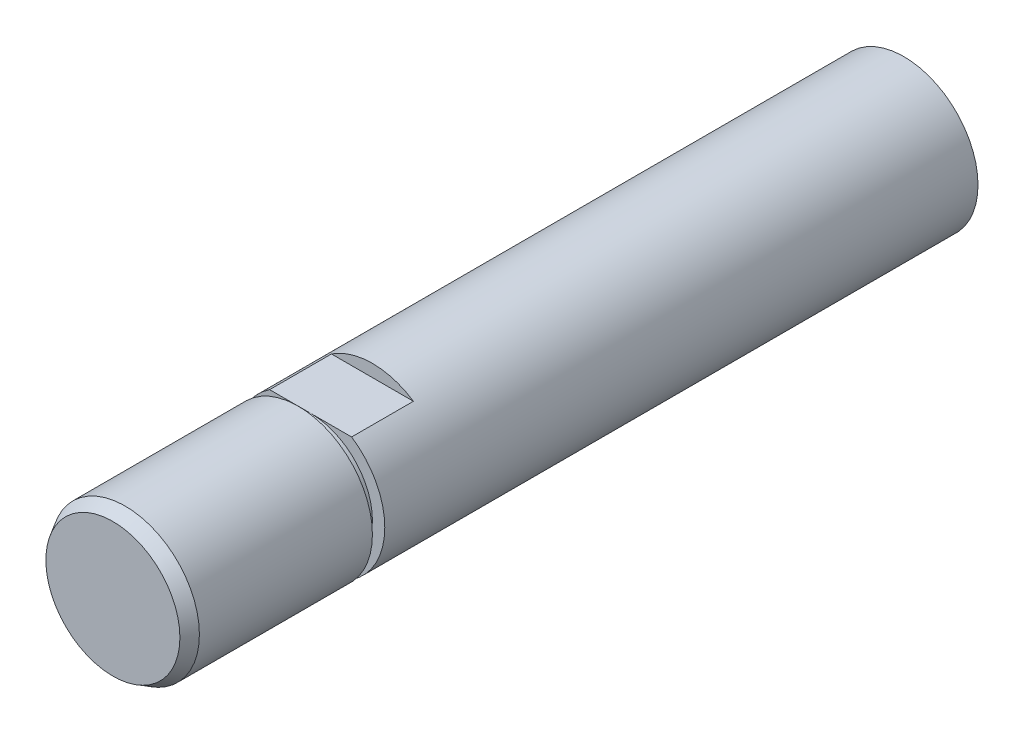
from build123d import *

# Parameters (mm, degrees)
SKETCH1_R          = 6
EXTRUDE1_DEPTH     = 40
EXTRUDE2_START     = 8
SKETCH2_R          = 6
EXTRUDE2_DEPTH     = 8
EXTRUDE3_START     = 16
SKETCH3_R          = 6
EXTRUDE3_DEPTH     = 16
CHAMFER2_SIZE      = 1
CHAMFER2_SIZE2     = 0.577350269
SKETCH5_R          = 6.5
SKETCH5_R_2        = 5
CUT_EXTRUDE1_DEPTH = 1
SKETCH6_W          = 5
SKETCH6_H          = 5.381540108
SKETCH6_H_2        = 6.212063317
CUT_EXTRUDE2_DEPTH = 10.5


with BuildPart() as part:
    # Sketch1 → Extrude1 (new body)
    with BuildSketch(Plane.XY):
        Circle(SKETCH1_R)
    extrude(amount=-EXTRUDE1_DEPTH)

    # Sketch2 → Extrude2 (add)
    with BuildSketch(Plane.XY.offset(EXTRUDE2_START)):
        Circle(SKETCH2_R)
    extrude(amount=-EXTRUDE2_DEPTH)

    # Sketch3 → Extrude3 (add)
    with BuildSketch(Plane.XY.offset(8).offset(EXTRUDE3_START)):
        Circle(SKETCH3_R)
    extrude(amount=-EXTRUDE3_DEPTH)

    # Chamfer2
    chamfer2_edges = [part.edges().sort_by_distance(p)[0] for p in [
        (-6, 0, 24),
    ]]
    chamfer2_side = [part.faces().sort_by_distance(p)[0] for p in [
        (-6, 0, -8),
    ]]
    chamfer(chamfer2_edges, length=CHAMFER2_SIZE, length2=CHAMFER2_SIZE2, reference=chamfer2_side[0])

    # Sketch5 → Cut-Extrude1 (cut)
    with BuildSketch(Plane.XY.offset(8)):
        Circle(SKETCH5_R)
        Circle(SKETCH5_R_2, mode=Mode.SUBTRACT)
    extrude(amount=CUT_EXTRUDE1_DEPTH, mode=Mode.SUBTRACT)

    # Sketch6 → Cut-Extrude2 (cut, symmetric)
    with BuildSketch(Plane(origin=(0, 0, 0), x_dir=(0, 0, -1), z_dir=(1, 0, 0))):
        with Locations((-5.5, 7.690770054)):
            Rectangle(SKETCH6_W, SKETCH6_H)
        with Locations((-5.5, -8.106031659)):
            Rectangle(SKETCH6_W, SKETCH6_H_2)
    extrude(amount=CUT_EXTRUDE2_DEPTH, both=True, mode=Mode.SUBTRACT)


solid = part.part
